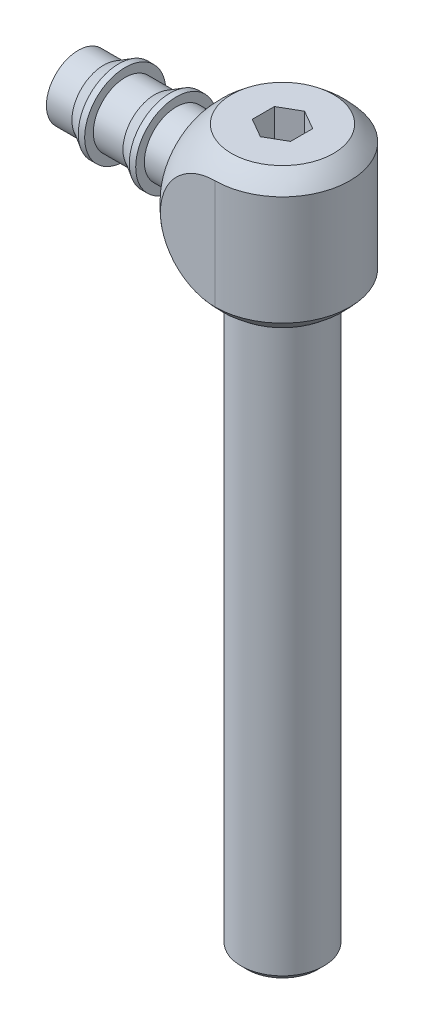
from build123d import *

# Parameters (mm, degrees)
CUT_EXTRUDE1_DEPTH      = 30.738319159
CUT_EXTRUDE1_DEPTH_BACK = 30.738319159
SKETCH3_OUTSIDE_W       = 31.068
SKETCH3_OUTSIDE_H       = 31.068
CUT_EXTRUDE2_DEPTH      = 29.139286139
CUT_EXTRUDE2_DEPTH_BACK = 29.139286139
SKETCH4_OUTSIDE_W       = 25.178
SKETCH4_OUTSIDE_H       = 30.004
SKETCH4_OUTSIDE_W_2     = 25.4
SKETCH4_OUTSIDE_H_2     = 17.4625
FILLET1_R               = 0.79375
CUT_EXTRUDE3_START      = -25.4
SKETCH10_R              = 2.69875
CUT_EXTRUDE3_DEPTH      = 25.4
CUT_EXTRUDE4_DEPTH      = 3.96875
SKETCH13_R              = 3.175
CUT_EXTRUDE5_DEPTH      = 82.8675


with BuildPart() as part:
    # Sketch1 → Revolve1 (revolve)
    with BuildSketch(Plane.XY):
        with BuildLine():
            Line((0, 25.52065), (0, 3.93065))
            ThreePointArc((0, 3.93065), (10.795, 14.72565), (0, 25.52065))
        make_face()
    revolve(axis=Axis((0, 0, 0), (0, 1, 0)))

    # Sketch3 outside → Cut-Extrude1 (cut, two sides: drawn at the far end of the back side and taken through both)
    with BuildSketch(Plane(origin=(0, 0, 0), x_dir=(1, 0, 0), z_dir=(0, 1, 0)).offset(-CUT_EXTRUDE1_DEPTH_BACK)):
        Rectangle(SKETCH3_OUTSIDE_W, SKETCH3_OUTSIDE_H)
        with BuildLine():
            Line((0, -8.382), (-8.382, -8.382))
            Line((-8.382, -8.382), (-8.382, 8.382))
            Line((-8.382, 8.382), (0, 8.382))
            ThreePointArc((0, 8.382), (8.382, 0), (0, -8.382))
        make_face(mode=Mode.SUBTRACT)
    extrude(amount=CUT_EXTRUDE1_DEPTH + CUT_EXTRUDE1_DEPTH_BACK, mode=Mode.SUBTRACT)

    # Sketch4 outside → Cut-Extrude2 (cut, two sides: drawn at the far end of the back side and taken through both)
    with BuildSketch(Plane.XY.offset(-CUT_EXTRUDE2_DEPTH_BACK)):
        with Locations((0, 14.726)):
            Rectangle(SKETCH4_OUTSIDE_W, SKETCH4_OUTSIDE_H)
        with Locations((0, 14.72565)):
            Rectangle(SKETCH4_OUTSIDE_W_2, SKETCH4_OUTSIDE_H_2, mode=Mode.SUBTRACT)
    extrude(amount=CUT_EXTRUDE2_DEPTH + CUT_EXTRUDE2_DEPTH_BACK, mode=Mode.SUBTRACT)

    # Sketch9 → Revolve2 (revolve)
    with BuildSketch(Plane(origin=(0, 14.72565, 0), x_dir=(1, 0, 0), z_dir=(0, 1, 0)), mode=Mode.PRIVATE) as revolve2_sk:
        Polygon((-25.4, 0), (-25.4, 3.96875), (-22.225, 3.96875), (-20.355251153, 5.04825), (-19.561501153, 5.04825), (-19.561501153, 3.96875), (-15.875, 3.96875), (-14.005251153, 5.04825), (-13.211501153, 5.04825), (-13.211501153, 3.96875), (0, 3.96875), (0, 0), align=None)
    revolve(revolve2_sk.sketch.rotate(Axis((0, 14.72565, 0), (1, 0, 0)), 180), axis=Axis((0, 14.72565, 0), (1, 0, 0)))

    # Fillet1
    fillet1_edges = [part.edges().sort_by_distance(p)[0] for p in [
        (-8.382, 14.72565, -3.96875),
    ]]
    fillet(fillet1_edges, radius=FILLET1_R)

    # Sketch10 → Cut-Extrude3 (cut)
    with BuildSketch(Plane.ZY.offset(25.4).offset(CUT_EXTRUDE3_START)):
        with Locations((0, 14.72565)):
            Circle(SKETCH10_R)
    extrude(amount=CUT_EXTRUDE3_DEPTH, mode=Mode.SUBTRACT)

    # Sketch11 → Revolve3 (revolve)
    with BuildSketch(Plane.XY, mode=Mode.PRIVATE) as revolve3_sk:
        Polygon((5.1435, -64.6811), (5.1435, 2.8194), (5.1435, 5.9944), (0, 5.9944), (0, -65.4431), (4.3815, -65.4431), align=None)
    revolve(revolve3_sk.sketch.rotate(Axis((0, -11.634020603, 0), (0, -1, 0)), 270), axis=Axis((0, -11.634020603, 0), (0, -1, 0)))

    # Sketch12 → Cut-Extrude4 (cut)
    with BuildSketch(Plane(origin=(0, 23.4569, 0), x_dir=(1, 0, 0), z_dir=(0, 1, 0))):
        Polygon((0, -2.749630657), (2.38125, -1.374815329), (2.38125, 1.374815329), (0, 2.749630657), (-2.38125, 1.374815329), (-2.38125, -1.374815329), align=None)
    extrude(amount=-CUT_EXTRUDE4_DEPTH, mode=Mode.SUBTRACT)

    # Sketch13 → Cut-Extrude5 (cut)
    with BuildSketch(Plane.XZ.offset(65.4431)):
        Circle(SKETCH13_R)
    extrude(amount=-CUT_EXTRUDE5_DEPTH, mode=Mode.SUBTRACT)


solid = part.part
